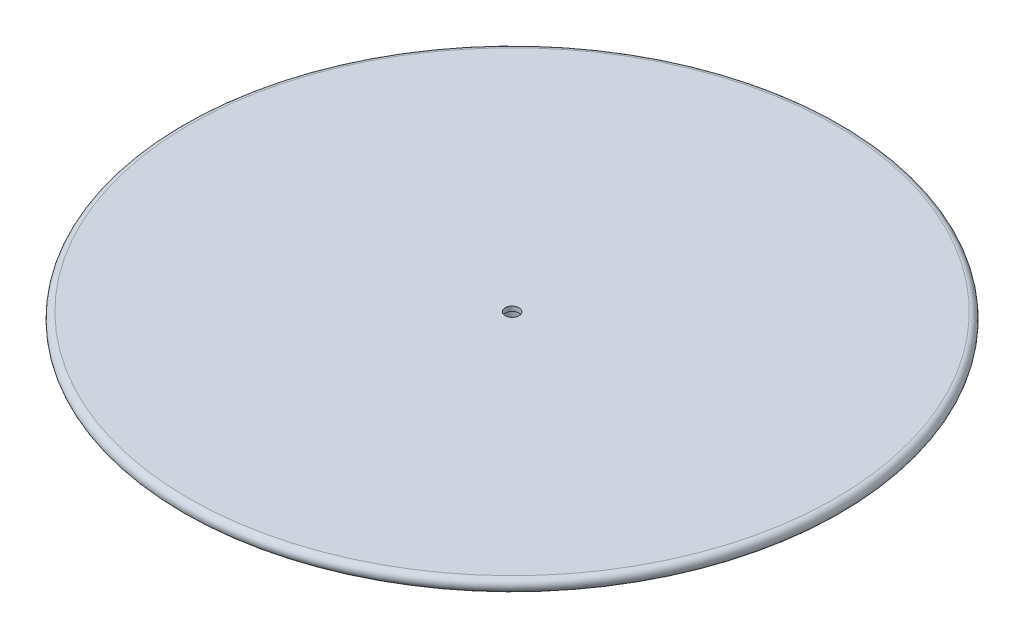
ISO-10303-21;
HEADER;
FILE_DESCRIPTION(('STEP AP214'),'2;1');
FILE_NAME('part.step','',(''),(''),'','','');
FILE_SCHEMA(('AUTOMOTIVE_DESIGN { 1 0 10303 214 1 1 1 1 }'));
ENDSEC;
DATA;
#1=APPLICATION_CONTEXT('core data for automotive mechanical design processes');
#2=APPLICATION_PROTOCOL_DEFINITION('international standard','automotive_design',2000,#1);
#3=PRODUCT_CONTEXT('',#1,'mechanical');
#4=PRODUCT('Part','Part','',(#3));
#5=PRODUCT_RELATED_PRODUCT_CATEGORY('part','',(#4));
#6=PRODUCT_DEFINITION_FORMATION('','',#4);
#7=PRODUCT_DEFINITION_CONTEXT('part definition',#1,'design');
#8=PRODUCT_DEFINITION('design','',#6,#7);
#9=PRODUCT_DEFINITION_SHAPE('','',#8);
#10=(LENGTH_UNIT() NAMED_UNIT(*) SI_UNIT(.MILLI.,.METRE.));
#11=(NAMED_UNIT(*) PLANE_ANGLE_UNIT() SI_UNIT($,.RADIAN.));
#12=(NAMED_UNIT(*) SI_UNIT($,.STERADIAN.) SOLID_ANGLE_UNIT());
#13=UNCERTAINTY_MEASURE_WITH_UNIT(LENGTH_MEASURE(1.E-05),#10,'distance_accuracy_value','');
#14=(GEOMETRIC_REPRESENTATION_CONTEXT(3) GLOBAL_UNCERTAINTY_ASSIGNED_CONTEXT((#13)) GLOBAL_UNIT_ASSIGNED_CONTEXT((#10,
#11,#12)) REPRESENTATION_CONTEXT('',''));
#15=CARTESIAN_POINT('',(0.,0.,0.));
#16=DIRECTION('',(0.,0.,1.));
#17=DIRECTION('',(1.,0.,0.));
#18=AXIS2_PLACEMENT_3D('',#15,#16,#17);
#19=CARTESIAN_POINT('',(0.,9.525,0.));
#20=DIRECTION('',(0.,1.,0.));
#21=DIRECTION('',(0.,0.,1.));
#22=AXIS2_PLACEMENT_3D('',#19,#20,#21);
#23=TOROIDAL_SURFACE('',#22,490.475,9.525);
#24=CARTESIAN_POINT('',(0.,19.05,0.));
#25=DIRECTION('',(0.,1.,0.));
#26=DIRECTION('',(0.,0.,1.));
#27=AXIS2_PLACEMENT_3D('',#24,#25,#26);
#28=CIRCLE('',#27,490.475);
#29=CARTESIAN_POINT('',(0.,19.05,490.475));
#30=VERTEX_POINT('',#29);
#31=EDGE_CURVE('E70',#30,#30,#28,.T.);
#32=ORIENTED_EDGE('',*,*,#31,.F.);
#33=EDGE_LOOP('',(#32));
#34=FACE_BOUND('',#33,.T.);
#35=CARTESIAN_POINT('',(0.,0.,0.));
#36=DIRECTION('',(0.,1.,0.));
#37=DIRECTION('',(0.,0.,1.));
#38=AXIS2_PLACEMENT_3D('',#35,#36,#37);
#39=CIRCLE('',#38,490.475);
#40=CARTESIAN_POINT('',(0.,0.,490.475));
#41=VERTEX_POINT('',#40);
#42=EDGE_CURVE('E64',#41,#41,#39,.F.);
#43=ORIENTED_EDGE('',*,*,#42,.F.);
#44=EDGE_LOOP('',(#43));
#45=FACE_BOUND('',#44,.T.);
#46=ADVANCED_FACE('F45',(#34,#45),#23,.T.);
#47=CARTESIAN_POINT('',(0.,19.05,0.));
#48=DIRECTION('',(0.,1.,0.));
#49=DIRECTION('',(0.,0.,1.));
#50=AXIS2_PLACEMENT_3D('',#47,#48,#49);
#51=PLANE('',#50);
#52=CARTESIAN_POINT('',(0.,19.05,0.));
#53=DIRECTION('',(0.,-1.,0.));
#54=DIRECTION('',(0.,0.,-1.));
#55=AXIS2_PLACEMENT_3D('',#52,#53,#54);
#56=CIRCLE('',#55,10.499999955);
#57=CARTESIAN_POINT('',(0.,19.05,-10.499999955));
#58=VERTEX_POINT('',#57);
#59=EDGE_CURVE('E90',#58,#58,#56,.T.);
#60=ORIENTED_EDGE('',*,*,#59,.T.);
#61=EDGE_LOOP('',(#60));
#62=FACE_BOUND('',#61,.T.);
#63=ORIENTED_EDGE('',*,*,#31,.T.);
#64=EDGE_LOOP('',(#63));
#65=FACE_BOUND('',#64,.T.);
#66=ADVANCED_FACE('F95',(#62,#65),#51,.T.);
#67=CARTESIAN_POINT('',(0.,0.,0.));
#68=DIRECTION('',(0.,1.,0.));
#69=DIRECTION('',(0.,0.,1.));
#70=AXIS2_PLACEMENT_3D('',#67,#68,#69);
#71=PLANE('',#70);
#72=CARTESIAN_POINT('',(0.,0.,0.));
#73=DIRECTION('',(0.,1.,0.));
#74=DIRECTION('',(0.,0.,1.));
#75=AXIS2_PLACEMENT_3D('',#72,#73,#74);
#76=CIRCLE('',#75,459.475);
#77=CARTESIAN_POINT('',(0.,0.,459.475));
#78=VERTEX_POINT('',#77);
#79=EDGE_CURVE('E59',#78,#78,#76,.T.);
#80=ORIENTED_EDGE('',*,*,#79,.T.);
#81=EDGE_LOOP('',(#80));
#82=FACE_BOUND('',#81,.T.);
#83=ORIENTED_EDGE('',*,*,#42,.T.);
#84=EDGE_LOOP('',(#83));
#85=FACE_BOUND('',#84,.T.);
#86=ADVANCED_FACE('F121',(#82,#85),#71,.F.);
#87=CARTESIAN_POINT('',(0.,4.,0.));
#88=DIRECTION('',(0.,-1.,0.));
#89=DIRECTION('',(0.,0.,-1.));
#90=AXIS2_PLACEMENT_3D('',#87,#88,#89);
#91=PLANE('',#90);
#92=CARTESIAN_POINT('',(0.,4.,0.));
#93=DIRECTION('',(0.,-1.,0.));
#94=DIRECTION('',(0.,0.,-1.));
#95=AXIS2_PLACEMENT_3D('',#92,#93,#94);
#96=CIRCLE('',#95,458.019119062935);
#97=CARTESIAN_POINT('',(0.,4.,-458.019119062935));
#98=VERTEX_POINT('',#97);
#99=EDGE_CURVE('E10',#98,#98,#96,.T.);
#100=ORIENTED_EDGE('',*,*,#99,.T.);
#101=EDGE_LOOP('',(#100));
#102=FACE_BOUND('',#101,.T.);
#103=CARTESIAN_POINT('',(0.,4.,0.));
#104=DIRECTION('',(0.,-1.,0.));
#105=DIRECTION('',(0.,0.,-1.));
#106=AXIS2_PLACEMENT_3D('',#103,#104,#105);
#107=CIRCLE('',#106,405.475);
#108=CARTESIAN_POINT('',(0.,4.,-405.475));
#109=VERTEX_POINT('',#108);
#110=EDGE_CURVE('E74',#109,#109,#107,.T.);
#111=ORIENTED_EDGE('',*,*,#110,.F.);
#112=EDGE_LOOP('',(#111));
#113=FACE_BOUND('',#112,.T.);
#114=ADVANCED_FACE('F119',(#102,#113),#91,.T.);
#115=CARTESIAN_POINT('',(0.,0.,0.));
#116=DIRECTION('',(0.,-1.,0.));
#117=DIRECTION('',(0.,0.,-1.));
#118=AXIS2_PLACEMENT_3D('',#115,#116,#117);
#119=CIRCLE('',#118,12.500000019);
#120=CARTESIAN_POINT('',(0.,0.,-12.500000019));
#121=VERTEX_POINT('',#120);
#122=EDGE_CURVE('E78',#121,#121,#119,.T.);
#123=ORIENTED_EDGE('',*,*,#122,.F.);
#124=EDGE_LOOP('',(#123));
#125=FACE_BOUND('',#124,.T.);
#126=CARTESIAN_POINT('',(0.,0.,0.));
#127=DIRECTION('',(0.,1.,0.));
#128=DIRECTION('',(0.,0.,1.));
#129=AXIS2_PLACEMENT_3D('',#126,#127,#128);
#130=CIRCLE('',#129,394.485090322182);
#131=CARTESIAN_POINT('',(0.,0.,394.485090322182));
#132=VERTEX_POINT('',#131);
#133=EDGE_CURVE('E54',#132,#132,#130,.F.);
#134=ORIENTED_EDGE('',*,*,#133,.T.);
#135=EDGE_LOOP('',(#134));
#136=FACE_BOUND('',#135,.T.);
#137=ADVANCED_FACE('F116',(#125,#136),#71,.F.);
#138=CARTESIAN_POINT('',(0.,10.9899096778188,0.));
#139=DIRECTION('',(0.,-1.,0.));
#140=DIRECTION('',(0.,0.,-1.));
#141=AXIS2_PLACEMENT_3D('',#138,#139,#140);
#142=CONICAL_SURFACE('',#141,455.475,0.349065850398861);
#143=ORIENTED_EDGE('',*,*,#79,.F.);
#144=EDGE_LOOP('',(#143));
#145=FACE_BOUND('',#144,.T.);
#146=ORIENTED_EDGE('',*,*,#99,.F.);
#147=EDGE_LOOP('',(#146));
#148=FACE_BOUND('',#147,.T.);
#149=ADVANCED_FACE('F118',(#145,#148),#142,.F.);
#150=CARTESIAN_POINT('',(0.,0.,0.));
#151=DIRECTION('',(0.,1.,0.));
#152=DIRECTION('',(0.,0.,1.));
#153=AXIS2_PLACEMENT_3D('',#150,#151,#152);
#154=CONICAL_SURFACE('',#153,394.485090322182,1.22173047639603);
#155=ORIENTED_EDGE('',*,*,#110,.T.);
#156=EDGE_LOOP('',(#155));
#157=FACE_BOUND('',#156,.T.);
#158=ORIENTED_EDGE('',*,*,#133,.F.);
#159=EDGE_LOOP('',(#158));
#160=FACE_BOUND('',#159,.T.);
#161=ADVANCED_FACE('F48',(#157,#160),#154,.T.);
#162=CARTESIAN_POINT('',(0.,0.,0.));
#163=DIRECTION('',(0.,-1.,0.));
#164=DIRECTION('',(0.,0.,-1.));
#165=AXIS2_PLACEMENT_3D('',#162,#163,#164);
#166=CYLINDRICAL_SURFACE('',#165,12.500000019);
#167=CARTESIAN_POINT('',(0.,11.999999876,0.));
#168=DIRECTION('',(0.,-1.,0.));
#169=DIRECTION('',(0.,0.,-1.));
#170=AXIS2_PLACEMENT_3D('',#167,#168,#169);
#171=CIRCLE('',#170,12.500000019);
#172=CARTESIAN_POINT('',(0.,11.999999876,-12.500000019));
#173=VERTEX_POINT('',#172);
#174=EDGE_CURVE('E82',#173,#173,#171,.T.);
#175=ORIENTED_EDGE('',*,*,#174,.F.);
#176=EDGE_LOOP('',(#175));
#177=FACE_BOUND('',#176,.T.);
#178=ORIENTED_EDGE('',*,*,#122,.T.);
#179=EDGE_LOOP('',(#178));
#180=FACE_BOUND('',#179,.T.);
#181=ADVANCED_FACE('F107',(#177,#180),#166,.F.);
#182=CARTESIAN_POINT('',(12.500000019,11.999999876,0.));
#183=DIRECTION('',(0.,1.,0.));
#184=DIRECTION('',(0.,0.,1.));
#185=AXIS2_PLACEMENT_3D('',#182,#183,#184);
#186=PLANE('',#185);
#187=CARTESIAN_POINT('',(0.,11.999999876,0.));
#188=DIRECTION('',(0.,-1.,0.));
#189=DIRECTION('',(0.,0.,-1.));
#190=AXIS2_PLACEMENT_3D('',#187,#188,#189);
#191=CIRCLE('',#190,10.499999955);
#192=CARTESIAN_POINT('',(0.,11.999999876,-10.499999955));
#193=VERTEX_POINT('',#192);
#194=EDGE_CURVE('E86',#193,#193,#191,.T.);
#195=ORIENTED_EDGE('',*,*,#194,.F.);
#196=EDGE_LOOP('',(#195));
#197=FACE_BOUND('',#196,.T.);
#198=ORIENTED_EDGE('',*,*,#174,.T.);
#199=EDGE_LOOP('',(#198));
#200=FACE_BOUND('',#199,.T.);
#201=ADVANCED_FACE('F101',(#197,#200),#186,.F.);
#202=CARTESIAN_POINT('',(0.,0.,0.));
#203=DIRECTION('',(0.,-1.,0.));
#204=DIRECTION('',(0.,0.,-1.));
#205=AXIS2_PLACEMENT_3D('',#202,#203,#204);
#206=CYLINDRICAL_SURFACE('',#205,10.499999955);
#207=ORIENTED_EDGE('',*,*,#59,.F.);
#208=EDGE_LOOP('',(#207));
#209=FACE_BOUND('',#208,.T.);
#210=ORIENTED_EDGE('',*,*,#194,.T.);
#211=EDGE_LOOP('',(#210));
#212=FACE_BOUND('',#211,.T.);
#213=ADVANCED_FACE('F98',(#209,#212),#206,.F.);
#214=CLOSED_SHELL('',(#46,#66,#86,#114,#137,#149,#161,#181,#201,#213));
#215=MANIFOLD_SOLID_BREP('B2',#214);
#216=ADVANCED_BREP_SHAPE_REPRESENTATION('',(#18,#215),#14);
#217=SHAPE_DEFINITION_REPRESENTATION(#9,#216);
ENDSEC;
END-ISO-10303-21;
